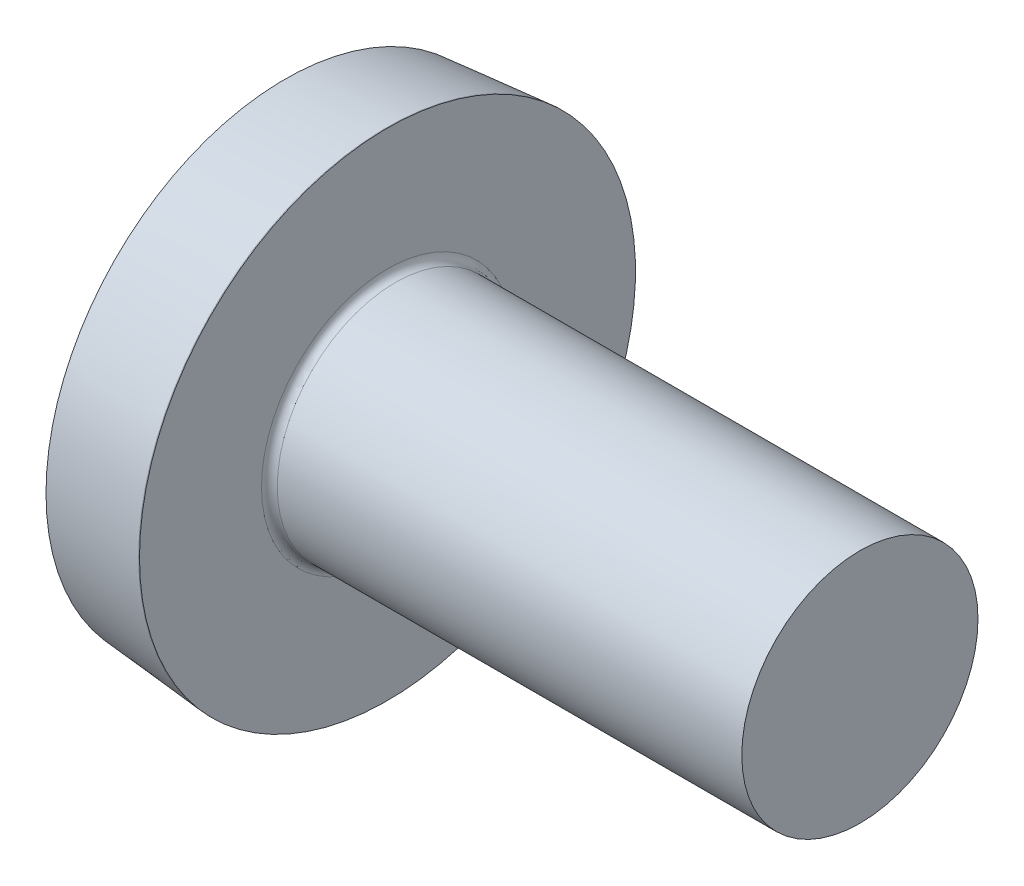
ISO-10303-21;
HEADER;
FILE_DESCRIPTION(('STEP AP214'),'2;1');
FILE_NAME('part.step','',(''),(''),'','','');
FILE_SCHEMA(('AUTOMOTIVE_DESIGN { 1 0 10303 214 1 1 1 1 }'));
ENDSEC;
DATA;
#1=APPLICATION_CONTEXT('core data for automotive mechanical design processes');
#2=APPLICATION_PROTOCOL_DEFINITION('international standard','automotive_design',2000,#1);
#3=PRODUCT_CONTEXT('',#1,'mechanical');
#4=PRODUCT('Part','Part','',(#3));
#5=PRODUCT_RELATED_PRODUCT_CATEGORY('part','',(#4));
#6=PRODUCT_DEFINITION_FORMATION('','',#4);
#7=PRODUCT_DEFINITION_CONTEXT('part definition',#1,'design');
#8=PRODUCT_DEFINITION('design','',#6,#7);
#9=PRODUCT_DEFINITION_SHAPE('','',#8);
#10=(LENGTH_UNIT() NAMED_UNIT(*) SI_UNIT(.MILLI.,.METRE.));
#11=(NAMED_UNIT(*) PLANE_ANGLE_UNIT() SI_UNIT($,.RADIAN.));
#12=(NAMED_UNIT(*) SI_UNIT($,.STERADIAN.) SOLID_ANGLE_UNIT());
#13=UNCERTAINTY_MEASURE_WITH_UNIT(LENGTH_MEASURE(1.E-05),#10,'distance_accuracy_value','');
#14=(GEOMETRIC_REPRESENTATION_CONTEXT(3) GLOBAL_UNCERTAINTY_ASSIGNED_CONTEXT((#13)) GLOBAL_UNIT_ASSIGNED_CONTEXT((#10,
#11,#12)) REPRESENTATION_CONTEXT('',''));
#15=CARTESIAN_POINT('',(0.,0.,0.));
#16=DIRECTION('',(0.,0.,1.));
#17=DIRECTION('',(1.,0.,0.));
#18=AXIS2_PLACEMENT_3D('',#15,#16,#17);
#19=CARTESIAN_POINT('',(7.98684757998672,0.,0.));
#20=DIRECTION('',(-1.,0.,0.));
#21=DIRECTION('',(0.,1.,0.));
#22=AXIS2_PLACEMENT_3D('',#19,#20,#21);
#23=SPHERICAL_SURFACE('',#22,7.98684757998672);
#24=CARTESIAN_POINT('',(0.6,0.,0.));
#25=DIRECTION('',(-1.,0.,0.));
#26=DIRECTION('',(0.,0.,1.));
#27=AXIS2_PLACEMENT_3D('',#24,#25,#26);
#28=CIRCLE('',#27,3.03713962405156);
#29=CARTESIAN_POINT('',(0.6,0.,3.03713962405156));
#30=VERTEX_POINT('',#29);
#31=EDGE_CURVE('E214',#30,#30,#28,.T.);
#32=ORIENTED_EDGE('',*,*,#31,.T.);
#33=EDGE_LOOP('',(#32));
#34=FACE_BOUND('',#33,.T.);
#35=CARTESIAN_POINT('',(0.057179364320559,0.,0.));
#36=DIRECTION('',(1.,0.,0.));
#37=DIRECTION('',(0.,0.,-1.));
#38=AXIS2_PLACEMENT_3D('',#35,#36,#37);
#39=CIRCLE('',#38,0.953989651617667);
#40=CARTESIAN_POINT('',(0.0571793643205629,-0.514999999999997,-0.80303876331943));
#41=VERTEX_POINT('',#40);
#42=CARTESIAN_POINT('',(0.0571793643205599,-0.803038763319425,-0.515));
#43=VERTEX_POINT('',#42);
#44=EDGE_CURVE('E341',#41,#43,#39,.F.);
#45=ORIENTED_EDGE('',*,*,#44,.F.);
#46=CARTESIAN_POINT('',(7.98684757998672,-0.515,0.));
#47=DIRECTION('',(0.,1.,0.));
#48=DIRECTION('',(0.,0.,1.));
#49=AXIS2_PLACEMENT_3D('',#46,#47,#48);
#50=CIRCLE('',#49,7.97022642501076);
#51=CARTESIAN_POINT('',(0.210052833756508,-0.514999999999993,-1.7452715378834));
#52=VERTEX_POINT('',#51);
#53=EDGE_CURVE('E274',#52,#41,#50,.T.);
#54=ORIENTED_EDGE('',*,*,#53,.F.);
#55=CARTESIAN_POINT('',(7.13546441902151,0.,1.70761072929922));
#56=DIRECTION('',(0.446197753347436,0.,-0.894934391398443));
#57=DIRECTION('',(-0.894934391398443,0.,-0.446197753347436));
#58=AXIS2_PLACEMENT_3D('',#55,#56,#57);
#59=CIRCLE('',#58,7.75557519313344);
#60=CARTESIAN_POINT('',(0.210052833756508,0.515000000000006,-1.7452715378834));
#61=VERTEX_POINT('',#60);
#62=EDGE_CURVE('E248',#52,#61,#59,.T.);
#63=ORIENTED_EDGE('',*,*,#62,.T.);
#64=CARTESIAN_POINT('',(7.98684757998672,0.515,0.));
#65=DIRECTION('',(0.,-1.,0.));
#66=DIRECTION('',(0.,0.,-1.));
#67=AXIS2_PLACEMENT_3D('',#64,#65,#66);
#68=CIRCLE('',#67,7.97022642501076);
#69=CARTESIAN_POINT('',(0.0571793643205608,0.515000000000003,-0.803038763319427));
#70=VERTEX_POINT('',#69);
#71=EDGE_CURVE('E303',#70,#61,#68,.T.);
#72=ORIENTED_EDGE('',*,*,#71,.F.);
#73=CARTESIAN_POINT('',(0.0571793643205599,0.803038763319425,-0.515));
#74=VERTEX_POINT('',#73);
#75=EDGE_CURVE('E356',#74,#70,#39,.F.);
#76=ORIENTED_EDGE('',*,*,#75,.F.);
#77=CARTESIAN_POINT('',(7.98684757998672,0.,-0.515));
#78=DIRECTION('',(0.,0.,1.));
#79=DIRECTION('',(1.,0.,0.));
#80=AXIS2_PLACEMENT_3D('',#77,#78,#79);
#81=CIRCLE('',#80,7.97022642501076);
#82=CARTESIAN_POINT('',(0.210052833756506,1.7452715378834,-0.515));
#83=VERTEX_POINT('',#82);
#84=EDGE_CURVE('E242',#83,#74,#81,.T.);
#85=ORIENTED_EDGE('',*,*,#84,.F.);
#86=CARTESIAN_POINT('',(7.13546441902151,-1.70761072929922,0.));
#87=DIRECTION('',(0.446197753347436,0.894934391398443,0.));
#88=DIRECTION('',(-0.894934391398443,0.446197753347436,0.));
#89=AXIS2_PLACEMENT_3D('',#86,#87,#88);
#90=CIRCLE('',#89,7.75557519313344);
#91=CARTESIAN_POINT('',(0.210052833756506,1.7452715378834,0.515));
#92=VERTEX_POINT('',#91);
#93=EDGE_CURVE('E245',#83,#92,#90,.T.);
#94=ORIENTED_EDGE('',*,*,#93,.T.);
#95=CARTESIAN_POINT('',(7.98684757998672,0.,0.515));
#96=DIRECTION('',(0.,0.,-1.));
#97=DIRECTION('',(0.,1.,0.));
#98=AXIS2_PLACEMENT_3D('',#95,#96,#97);
#99=CIRCLE('',#98,7.97022642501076);
#100=CARTESIAN_POINT('',(0.0571793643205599,0.803038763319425,0.515));
#101=VERTEX_POINT('',#100);
#102=EDGE_CURVE('E238',#101,#92,#99,.T.);
#103=ORIENTED_EDGE('',*,*,#102,.F.);
#104=CARTESIAN_POINT('',(0.0571793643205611,0.514999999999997,0.80303876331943));
#105=VERTEX_POINT('',#104);
#106=EDGE_CURVE('E355',#105,#101,#39,.F.);
#107=ORIENTED_EDGE('',*,*,#106,.F.);
#108=CARTESIAN_POINT('',(0.210052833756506,0.514999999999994,1.7452715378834));
#109=VERTEX_POINT('',#108);
#110=EDGE_CURVE('E258',#109,#105,#68,.T.);
#111=ORIENTED_EDGE('',*,*,#110,.F.);
#112=CARTESIAN_POINT('',(7.13546441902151,0.,-1.70761072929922));
#113=DIRECTION('',(0.446197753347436,0.,0.894934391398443));
#114=DIRECTION('',(0.894934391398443,0.,-0.446197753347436));
#115=AXIS2_PLACEMENT_3D('',#112,#113,#114);
#116=CIRCLE('',#115,7.75557519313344);
#117=CARTESIAN_POINT('',(0.210052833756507,-0.515000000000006,1.7452715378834));
#118=VERTEX_POINT('',#117);
#119=EDGE_CURVE('E49',#109,#118,#116,.T.);
#120=ORIENTED_EDGE('',*,*,#119,.T.);
#121=CARTESIAN_POINT('',(0.0571793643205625,-0.515000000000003,0.803038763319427));
#122=VERTEX_POINT('',#121);
#123=EDGE_CURVE('E255',#122,#118,#50,.T.);
#124=ORIENTED_EDGE('',*,*,#123,.F.);
#125=CARTESIAN_POINT('',(0.0571793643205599,-0.803038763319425,0.515));
#126=VERTEX_POINT('',#125);
#127=EDGE_CURVE('E391',#126,#122,#39,.F.);
#128=ORIENTED_EDGE('',*,*,#127,.F.);
#129=CARTESIAN_POINT('',(0.210052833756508,-1.7452715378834,0.515));
#130=VERTEX_POINT('',#129);
#131=EDGE_CURVE('E239',#130,#126,#99,.T.);
#132=ORIENTED_EDGE('',*,*,#131,.F.);
#133=CARTESIAN_POINT('',(7.13546441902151,1.70761072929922,0.));
#134=DIRECTION('',(0.446197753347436,-0.894934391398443,0.));
#135=DIRECTION('',(0.894934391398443,0.446197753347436,0.));
#136=AXIS2_PLACEMENT_3D('',#133,#134,#135);
#137=CIRCLE('',#136,7.75557519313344);
#138=CARTESIAN_POINT('',(0.210052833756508,-1.7452715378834,-0.515));
#139=VERTEX_POINT('',#138);
#140=EDGE_CURVE('E235',#130,#139,#137,.T.);
#141=ORIENTED_EDGE('',*,*,#140,.T.);
#142=EDGE_CURVE('E64',#43,#139,#81,.T.);
#143=ORIENTED_EDGE('',*,*,#142,.F.);
#144=EDGE_LOOP('',(#45,#54,#63,#72,#76,#85,#94,#103,#107,#111,#120,#124,#128,#132,#141,#143));
#145=FACE_BOUND('',#144,.T.);
#146=ADVANCED_FACE('F35',(#34,#145),#23,.T.);
#147=CARTESIAN_POINT('',(1.53,1.08717026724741,-0.515));
#148=DIRECTION('',(0.,0.,1.));
#149=DIRECTION('',(1.,0.,0.));
#150=AXIS2_PLACEMENT_3D('',#147,#148,#149);
#151=PLANE('',#150);
#152=ORIENTED_EDGE('',*,*,#84,.T.);
#153=CARTESIAN_POINT('',(-1.53096593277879,0.932251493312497,-0.515));
#154=CARTESIAN_POINT('',(-1.23829496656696,0.908862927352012,-0.515));
#155=CARTESIAN_POINT('',(-0.945638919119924,0.885284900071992,-0.515));
#156=CARTESIAN_POINT('',(-0.360361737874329,0.837606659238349,-0.515));
#157=CARTESIAN_POINT('',(-0.067740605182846,0.8135064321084,-0.515));
#158=CARTESIAN_POINT('',(0.517446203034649,0.764641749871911,-0.515));
#159=CARTESIAN_POINT('',(0.810011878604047,0.739877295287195,-0.515));
#160=CARTESIAN_POINT('',(1.24879921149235,0.702056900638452,-0.515));
#161=CARTESIAN_POINT('',(1.39504991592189,0.689337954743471,-0.515));
#162=CARTESIAN_POINT('',(1.68752880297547,0.663633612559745,-0.515));
#163=CARTESIAN_POINT('',(1.83375698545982,0.650648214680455,-0.515));
#164=CARTESIAN_POINT('',(2.22932735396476,0.615090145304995,-0.515));
#165=CARTESIAN_POINT('',(2.47864256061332,0.592216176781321,-0.515));
#166=CARTESIAN_POINT('',(2.97714936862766,0.545192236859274,-0.515));
#167=CARTESIAN_POINT('',(3.22634097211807,0.521042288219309,-0.515));
#168=CARTESIAN_POINT('',(3.59999645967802,0.483370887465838,-0.515));
#169=CARTESIAN_POINT('',(3.72453302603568,0.470571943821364,-0.515));
#170=CARTESIAN_POINT('',(3.97353967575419,0.444352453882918,-0.515));
#171=CARTESIAN_POINT('',(4.09800975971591,0.430931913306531,-0.515));
#172=CARTESIAN_POINT('',(4.34687040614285,0.403288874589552,-0.515));
#173=CARTESIAN_POINT('',(4.471260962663,0.389066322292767,-0.515));
#174=CARTESIAN_POINT('',(4.71990866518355,0.359471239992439,-0.515));
#175=CARTESIAN_POINT('',(4.84416580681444,0.344098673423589,-0.515));
#176=CARTESIAN_POINT('',(4.968329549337,0.327977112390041,-0.515));
#177=B_SPLINE_CURVE_WITH_KNOTS('',3,(#153,#154,#155,#156,#157,#158,#159,#160,#161,#162,#163,
#164,#165,#166,#167,#168,#169,#170,#171,#172,#173,#174,#175,#176),.UNSPECIFIED.,.F.,.F.,(4,2,2,
2,2,2,2,2,2,2,2,4),(0.,0.880812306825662,1.76164754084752,2.64248208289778,3.08289005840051,
3.52330066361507,4.27438561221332,5.02545716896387,5.40103352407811,5.77660642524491,
6.15220471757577,6.52781495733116),.UNSPECIFIED.);
#178=CARTESIAN_POINT('',(1.53,0.677477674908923,-0.515));
#179=VERTEX_POINT('',#178);
#180=EDGE_CURVE('E378',#74,#179,#177,.T.);
#181=ORIENTED_EDGE('',*,*,#180,.T.);
#182=DIRECTION('',(0.,1.,0.));
#183=VECTOR('',#182,1.);
#184=CARTESIAN_POINT('',(1.53,-1.08717026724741,-0.515));
#185=LINE('',#184,#183);
#186=CARTESIAN_POINT('',(1.53,1.08717026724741,-0.515));
#187=VERTEX_POINT('',#186);
#188=EDGE_CURVE('E324',#179,#187,#185,.T.);
#189=ORIENTED_EDGE('',*,*,#188,.T.);
#190=DIRECTION('',(0.894934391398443,-0.446197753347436,0.));
#191=VECTOR('',#190,1.);
#192=CARTESIAN_POINT('',(0.,1.85,-0.515));
#193=LINE('',#192,#191);
#194=EDGE_CURVE('E215',#83,#187,#193,.T.);
#195=ORIENTED_EDGE('',*,*,#194,.F.);
#196=EDGE_LOOP('',(#152,#181,#189,#195));
#197=FACE_BOUND('',#196,.T.);
#198=ADVANCED_FACE('F170',(#197),#151,.T.);
#199=CARTESIAN_POINT('',(1.53,-1.08717026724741,-0.515));
#200=VERTEX_POINT('',#199);
#201=CARTESIAN_POINT('',(1.53,-0.677477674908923,-0.515));
#202=VERTEX_POINT('',#201);
#203=EDGE_CURVE('E223',#200,#202,#185,.T.);
#204=ORIENTED_EDGE('',*,*,#203,.T.);
#205=CARTESIAN_POINT('',(-1.53096593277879,-0.932251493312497,-0.515));
#206=CARTESIAN_POINT('',(-1.23829496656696,-0.908862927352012,-0.515));
#207=CARTESIAN_POINT('',(-0.945638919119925,-0.885284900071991,-0.515));
#208=CARTESIAN_POINT('',(-0.360361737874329,-0.837606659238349,-0.515));
#209=CARTESIAN_POINT('',(-0.0677406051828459,-0.8135064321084,-0.515));
#210=CARTESIAN_POINT('',(0.517446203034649,-0.764641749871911,-0.515));
#211=CARTESIAN_POINT('',(0.810011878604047,-0.739877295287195,-0.515));
#212=CARTESIAN_POINT('',(1.24879921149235,-0.702056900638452,-0.515));
#213=CARTESIAN_POINT('',(1.39504991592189,-0.689337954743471,-0.515));
#214=CARTESIAN_POINT('',(1.68752880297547,-0.663633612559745,-0.515));
#215=CARTESIAN_POINT('',(1.83375698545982,-0.650648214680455,-0.515));
#216=CARTESIAN_POINT('',(2.22932735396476,-0.615090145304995,-0.515));
#217=CARTESIAN_POINT('',(2.47864256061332,-0.592216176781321,-0.515));
#218=CARTESIAN_POINT('',(2.97714936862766,-0.545192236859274,-0.515));
#219=CARTESIAN_POINT('',(3.22634097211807,-0.521042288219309,-0.515));
#220=CARTESIAN_POINT('',(3.59999645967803,-0.483370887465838,-0.515));
#221=CARTESIAN_POINT('',(3.72453302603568,-0.470571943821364,-0.515));
#222=CARTESIAN_POINT('',(3.97353967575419,-0.444352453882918,-0.515));
#223=CARTESIAN_POINT('',(4.09800975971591,-0.430931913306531,-0.515));
#224=CARTESIAN_POINT('',(4.34687040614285,-0.403288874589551,-0.515));
#225=CARTESIAN_POINT('',(4.471260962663,-0.389066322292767,-0.515));
#226=CARTESIAN_POINT('',(4.71990866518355,-0.359471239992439,-0.515));
#227=CARTESIAN_POINT('',(4.84416580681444,-0.344098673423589,-0.515));
#228=CARTESIAN_POINT('',(4.96832954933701,-0.32797711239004,-0.515));
#229=B_SPLINE_CURVE_WITH_KNOTS('',3,(#205,#206,#207,#208,#209,#210,#211,#212,#213,#214,#215,
#216,#217,#218,#219,#220,#221,#222,#223,#224,#225,#226,#227,#228),.UNSPECIFIED.,.F.,.F.,(4,2,2,
2,2,2,2,2,2,2,2,4),(0.,0.880812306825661,1.76164754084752,2.64248208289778,3.08289005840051,
3.52330066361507,4.27438561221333,5.02545716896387,5.40103352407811,5.77660642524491,
6.15220471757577,6.52781495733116),.UNSPECIFIED.);
#230=EDGE_CURVE('E354',#202,#43,#229,.F.);
#231=ORIENTED_EDGE('',*,*,#230,.T.);
#232=ORIENTED_EDGE('',*,*,#142,.T.);
#233=DIRECTION('',(0.894934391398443,0.446197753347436,0.));
#234=VECTOR('',#233,1.);
#235=CARTESIAN_POINT('',(0.,-1.85,-0.515));
#236=LINE('',#235,#234);
#237=EDGE_CURVE('E306',#139,#200,#236,.T.);
#238=ORIENTED_EDGE('',*,*,#237,.T.);
#239=EDGE_LOOP('',(#204,#231,#232,#238));
#240=FACE_BOUND('',#239,.T.);
#241=ADVANCED_FACE('F176',(#240),#151,.T.);
#242=CARTESIAN_POINT('',(1.53,-1.08717026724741,0.515));
#243=DIRECTION('',(0.,0.,-1.));
#244=DIRECTION('',(0.,1.,0.));
#245=AXIS2_PLACEMENT_3D('',#242,#243,#244);
#246=PLANE('',#245);
#247=DIRECTION('',(0.,-1.,0.));
#248=VECTOR('',#247,1.);
#249=CARTESIAN_POINT('',(1.53,1.08717026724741,0.515));
#250=LINE('',#249,#248);
#251=CARTESIAN_POINT('',(1.53,1.08717026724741,0.515));
#252=VERTEX_POINT('',#251);
#253=CARTESIAN_POINT('',(1.53,0.677477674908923,0.515));
#254=VERTEX_POINT('',#253);
#255=EDGE_CURVE('E314',#252,#254,#250,.T.);
#256=ORIENTED_EDGE('',*,*,#255,.T.);
#257=CARTESIAN_POINT('',(-1.53096593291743,0.932251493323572,0.515));
#258=CARTESIAN_POINT('',(-1.23829496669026,0.908862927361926,0.515));
#259=CARTESIAN_POINT('',(-0.945638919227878,0.885284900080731,0.515));
#260=CARTESIAN_POINT('',(-0.360361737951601,0.8376066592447,0.515));
#261=CARTESIAN_POINT('',(-0.0677406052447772,0.813506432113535,0.515));
#262=CARTESIAN_POINT('',(0.517446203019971,0.764641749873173,0.515));
#263=CARTESIAN_POINT('',(0.810011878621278,0.739877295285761,0.515));
#264=CARTESIAN_POINT('',(1.24879921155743,0.702056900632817,0.515));
#265=CARTESIAN_POINT('',(1.39504991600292,0.68933795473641,0.515));
#266=CARTESIAN_POINT('',(1.68752880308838,0.663633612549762,0.515));
#267=CARTESIAN_POINT('',(1.83375698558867,0.650648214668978,0.515));
#268=CARTESIAN_POINT('',(2.22932735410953,0.615090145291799,0.515));
#269=CARTESIAN_POINT('',(2.47864256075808,0.592216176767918,0.515));
#270=CARTESIAN_POINT('',(2.97714936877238,0.545192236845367,0.515));
#271=CARTESIAN_POINT('',(3.22634097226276,0.521042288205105,0.515));
#272=CARTESIAN_POINT('',(3.59999645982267,0.483370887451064,0.515));
#273=CARTESIAN_POINT('',(3.72453302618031,0.470571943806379,0.515));
#274=CARTESIAN_POINT('',(3.97353967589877,0.44435245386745,0.515));
#275=CARTESIAN_POINT('',(4.09800975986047,0.43093191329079,0.515));
#276=CARTESIAN_POINT('',(4.34687040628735,0.403288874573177,0.515));
#277=CARTESIAN_POINT('',(4.47126096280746,0.38906632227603,0.515));
#278=CARTESIAN_POINT('',(4.71990866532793,0.359471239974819,0.515));
#279=CARTESIAN_POINT('',(4.84416580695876,0.344098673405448,0.515));
#280=CARTESIAN_POINT('',(4.96832954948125,0.327977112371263,0.515));
#281=B_SPLINE_CURVE_WITH_KNOTS('',3,(#257,#258,#259,#260,#261,#262,#263,#264,#265,#266,#267,
#268,#269,#270,#271,#272,#273,#274,#275,#276,#277,#278,#279,#280),.UNSPECIFIED.,.F.,.F.,(4,2,2,
2,2,2,2,2,2,2,2,4),(0.,0.880812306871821,1.76164754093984,2.64248208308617,3.08289005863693,
3.52330066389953,4.27438561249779,5.02545716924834,5.4010335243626,5.77660642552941,
6.15220471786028,6.5278149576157),.UNSPECIFIED.);
#282=EDGE_CURVE('E279',#254,#101,#281,.F.);
#283=ORIENTED_EDGE('',*,*,#282,.T.);
#284=ORIENTED_EDGE('',*,*,#102,.T.);
#285=DIRECTION('',(0.894934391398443,-0.446197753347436,0.));
#286=VECTOR('',#285,1.);
#287=CARTESIAN_POINT('',(0.,1.85,0.515));
#288=LINE('',#287,#286);
#289=EDGE_CURVE('E220',#92,#252,#288,.T.);
#290=ORIENTED_EDGE('',*,*,#289,.T.);
#291=EDGE_LOOP('',(#256,#283,#284,#290));
#292=FACE_BOUND('',#291,.T.);
#293=ADVANCED_FACE('F374',(#292),#246,.T.);
#294=ORIENTED_EDGE('',*,*,#131,.T.);
#295=CARTESIAN_POINT('',(-1.53096593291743,-0.932251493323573,0.515));
#296=CARTESIAN_POINT('',(-1.23829496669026,-0.908862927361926,0.515));
#297=CARTESIAN_POINT('',(-0.945638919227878,-0.885284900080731,0.515));
#298=CARTESIAN_POINT('',(-0.360361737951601,-0.8376066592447,0.515));
#299=CARTESIAN_POINT('',(-0.0677406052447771,-0.813506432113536,0.515));
#300=CARTESIAN_POINT('',(0.517446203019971,-0.764641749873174,0.515));
#301=CARTESIAN_POINT('',(0.810011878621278,-0.739877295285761,0.515));
#302=CARTESIAN_POINT('',(1.24879921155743,-0.702056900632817,0.515));
#303=CARTESIAN_POINT('',(1.39504991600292,-0.68933795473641,0.515));
#304=CARTESIAN_POINT('',(1.68752880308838,-0.663633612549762,0.515));
#305=CARTESIAN_POINT('',(1.83375698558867,-0.650648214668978,0.515));
#306=CARTESIAN_POINT('',(2.22932735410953,-0.6150901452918,0.515));
#307=CARTESIAN_POINT('',(2.47864256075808,-0.592216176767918,0.515));
#308=CARTESIAN_POINT('',(2.97714936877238,-0.545192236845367,0.515));
#309=CARTESIAN_POINT('',(3.22634097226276,-0.521042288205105,0.515));
#310=CARTESIAN_POINT('',(3.59999645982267,-0.483370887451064,0.515));
#311=CARTESIAN_POINT('',(3.72453302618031,-0.470571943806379,0.515));
#312=CARTESIAN_POINT('',(3.97353967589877,-0.44435245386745,0.515));
#313=CARTESIAN_POINT('',(4.09800975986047,-0.43093191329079,0.515));
#314=CARTESIAN_POINT('',(4.34687040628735,-0.403288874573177,0.515));
#315=CARTESIAN_POINT('',(4.47126096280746,-0.389066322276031,0.515));
#316=CARTESIAN_POINT('',(4.71990866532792,-0.35947123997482,0.515));
#317=CARTESIAN_POINT('',(4.84416580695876,-0.344098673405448,0.515));
#318=CARTESIAN_POINT('',(4.96832954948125,-0.327977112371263,0.515));
#319=B_SPLINE_CURVE_WITH_KNOTS('',3,(#295,#296,#297,#298,#299,#300,#301,#302,#303,#304,#305,
#306,#307,#308,#309,#310,#311,#312,#313,#314,#315,#316,#317,#318),.UNSPECIFIED.,.F.,.F.,(4,2,2,
2,2,2,2,2,2,2,2,4),(0.,0.880812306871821,1.76164754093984,2.64248208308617,3.08289005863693,
3.52330066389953,4.27438561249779,5.02545716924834,5.4010335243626,5.77660642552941,
6.15220471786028,6.52781495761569),.UNSPECIFIED.);
#320=CARTESIAN_POINT('',(1.53,-0.677477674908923,0.515));
#321=VERTEX_POINT('',#320);
#322=EDGE_CURVE('E392',#126,#321,#319,.T.);
#323=ORIENTED_EDGE('',*,*,#322,.T.);
#324=CARTESIAN_POINT('',(1.53,-1.08717026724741,0.515));
#325=VERTEX_POINT('',#324);
#326=EDGE_CURVE('E316',#321,#325,#250,.T.);
#327=ORIENTED_EDGE('',*,*,#326,.T.);
#328=DIRECTION('',(0.894934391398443,0.446197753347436,0.));
#329=VECTOR('',#328,1.);
#330=CARTESIAN_POINT('',(0.,-1.85,0.515));
#331=LINE('',#330,#329);
#332=EDGE_CURVE('E308',#130,#325,#331,.T.);
#333=ORIENTED_EDGE('',*,*,#332,.F.);
#334=EDGE_LOOP('',(#294,#323,#327,#333));
#335=FACE_BOUND('',#334,.T.);
#336=ADVANCED_FACE('F422',(#335),#246,.T.);
#337=CARTESIAN_POINT('',(1.53,1.08717026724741,-0.515));
#338=DIRECTION('',(-1.,0.,0.));
#339=DIRECTION('',(0.,0.,1.));
#340=AXIS2_PLACEMENT_3D('',#337,#338,#339);
#341=PLANE('',#340);
#342=ORIENTED_EDGE('',*,*,#326,.F.);
#343=CARTESIAN_POINT('',(1.53,0.,0.));
#344=DIRECTION('',(-1.,0.,0.));
#345=DIRECTION('',(0.,0.,1.));
#346=AXIS2_PLACEMENT_3D('',#343,#344,#345);
#347=CIRCLE('',#346,0.851);
#348=EDGE_CURVE('E349',#202,#321,#347,.T.);
#349=ORIENTED_EDGE('',*,*,#348,.F.);
#350=ORIENTED_EDGE('',*,*,#203,.F.);
#351=DIRECTION('',(0.,0.,1.));
#352=VECTOR('',#351,1.);
#353=CARTESIAN_POINT('',(1.53,-1.08717026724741,-0.515));
#354=LINE('',#353,#352);
#355=EDGE_CURVE('E311',#200,#325,#354,.T.);
#356=ORIENTED_EDGE('',*,*,#355,.T.);
#357=EDGE_LOOP('',(#342,#349,#350,#356));
#358=FACE_BOUND('',#357,.T.);
#359=ADVANCED_FACE('F415',(#358),#341,.T.);
#360=DIRECTION('',(0.,0.,-1.));
#361=VECTOR('',#360,1.);
#362=CARTESIAN_POINT('',(1.53,-0.515000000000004,1.08717026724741));
#363=LINE('',#362,#361);
#364=CARTESIAN_POINT('',(1.53,-0.514999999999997,-0.677477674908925));
#365=VERTEX_POINT('',#364);
#366=CARTESIAN_POINT('',(1.53,-0.514999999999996,-1.08717026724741));
#367=VERTEX_POINT('',#366);
#368=EDGE_CURVE('E297',#365,#367,#363,.T.);
#369=ORIENTED_EDGE('',*,*,#368,.F.);
#370=CARTESIAN_POINT('',(1.53,0.515000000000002,-0.677477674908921));
#371=VERTEX_POINT('',#370);
#372=EDGE_CURVE('E56',#371,#365,#347,.T.);
#373=ORIENTED_EDGE('',*,*,#372,.F.);
#374=DIRECTION('',(0.,0.,1.));
#375=VECTOR('',#374,1.);
#376=CARTESIAN_POINT('',(1.53,0.515000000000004,-1.08717026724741));
#377=LINE('',#376,#375);
#378=CARTESIAN_POINT('',(1.53,0.515000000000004,-1.08717026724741));
#379=VERTEX_POINT('',#378);
#380=EDGE_CURVE('E300',#379,#371,#377,.T.);
#381=ORIENTED_EDGE('',*,*,#380,.F.);
#382=DIRECTION('',(0.,-1.,0.));
#383=VECTOR('',#382,1.);
#384=CARTESIAN_POINT('',(1.53,0.515000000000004,-1.08717026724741));
#385=LINE('',#384,#383);
#386=EDGE_CURVE('E291',#379,#367,#385,.T.);
#387=ORIENTED_EDGE('',*,*,#386,.T.);
#388=EDGE_LOOP('',(#369,#373,#381,#387));
#389=FACE_BOUND('',#388,.T.);
#390=ADVANCED_FACE('F344',(#389),#341,.T.);
#391=ORIENTED_EDGE('',*,*,#188,.F.);
#392=EDGE_CURVE('E348',#254,#179,#347,.T.);
#393=ORIENTED_EDGE('',*,*,#392,.F.);
#394=ORIENTED_EDGE('',*,*,#255,.F.);
#395=DIRECTION('',(0.,0.,-1.));
#396=VECTOR('',#395,1.);
#397=CARTESIAN_POINT('',(1.53,1.08717026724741,0.515));
#398=LINE('',#397,#396);
#399=EDGE_CURVE('E317',#252,#187,#398,.T.);
#400=ORIENTED_EDGE('',*,*,#399,.T.);
#401=EDGE_LOOP('',(#391,#393,#394,#400));
#402=FACE_BOUND('',#401,.T.);
#403=ADVANCED_FACE('F416',(#402),#341,.T.);
#404=CARTESIAN_POINT('',(1.53,0.514999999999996,1.08717026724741));
#405=DIRECTION('',(0.,-1.,0.));
#406=DIRECTION('',(1.,0.,0.));
#407=AXIS2_PLACEMENT_3D('',#404,#405,#406);
#408=PLANE('',#407);
#409=ORIENTED_EDGE('',*,*,#110,.T.);
#410=CARTESIAN_POINT('',(-1.53096593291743,0.514999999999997,0.932251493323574));
#411=CARTESIAN_POINT('',(-1.23829496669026,0.514999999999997,0.908862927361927));
#412=CARTESIAN_POINT('',(-0.945638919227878,0.514999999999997,0.885284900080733));
#413=CARTESIAN_POINT('',(-0.360361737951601,0.514999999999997,0.837606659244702));
#414=CARTESIAN_POINT('',(-0.0677406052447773,0.514999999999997,0.813506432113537));
#415=CARTESIAN_POINT('',(0.517446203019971,0.514999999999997,0.764641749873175));
#416=CARTESIAN_POINT('',(0.810011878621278,0.514999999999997,0.739877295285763));
#417=CARTESIAN_POINT('',(1.24879921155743,0.514999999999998,0.702056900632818));
#418=CARTESIAN_POINT('',(1.39504991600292,0.514999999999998,0.689337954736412));
#419=CARTESIAN_POINT('',(1.68752880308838,0.514999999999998,0.663633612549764));
#420=CARTESIAN_POINT('',(1.83375698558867,0.514999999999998,0.650648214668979));
#421=CARTESIAN_POINT('',(2.22932735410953,0.514999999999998,0.615090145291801));
#422=CARTESIAN_POINT('',(2.47864256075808,0.514999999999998,0.59221617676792));
#423=CARTESIAN_POINT('',(2.97714936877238,0.514999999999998,0.545192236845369));
#424=CARTESIAN_POINT('',(3.22634097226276,0.514999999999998,0.521042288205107));
#425=CARTESIAN_POINT('',(3.59999645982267,0.514999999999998,0.483370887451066));
#426=CARTESIAN_POINT('',(3.72453302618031,0.514999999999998,0.470571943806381));
#427=CARTESIAN_POINT('',(3.97353967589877,0.514999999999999,0.444352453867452));
#428=CARTESIAN_POINT('',(4.09800975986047,0.514999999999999,0.430931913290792));
#429=CARTESIAN_POINT('',(4.34687040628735,0.514999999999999,0.403288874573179));
#430=CARTESIAN_POINT('',(4.47126096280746,0.514999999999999,0.389066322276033));
#431=CARTESIAN_POINT('',(4.71990866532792,0.514999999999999,0.359471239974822));
#432=CARTESIAN_POINT('',(4.84416580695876,0.514999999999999,0.34409867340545));
#433=CARTESIAN_POINT('',(4.96832954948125,0.514999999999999,0.327977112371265));
#434=B_SPLINE_CURVE_WITH_KNOTS('',3,(#410,#411,#412,#413,#414,#415,#416,#417,#418,#419,#420,
#421,#422,#423,#424,#425,#426,#427,#428,#429,#430,#431,#432,#433),.UNSPECIFIED.,.F.,.F.,(4,2,2,
2,2,2,2,2,2,2,2,4),(0.,0.88081230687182,1.76164754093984,2.64248208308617,3.08289005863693,
3.52330066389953,4.27438561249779,5.02545716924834,5.4010335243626,5.77660642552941,
6.15220471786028,6.52781495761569),.UNSPECIFIED.);
#435=CARTESIAN_POINT('',(1.53,0.514999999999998,0.677477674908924));
#436=VERTEX_POINT('',#435);
#437=EDGE_CURVE('E440',#105,#436,#434,.T.);
#438=ORIENTED_EDGE('',*,*,#437,.T.);
#439=CARTESIAN_POINT('',(1.53,0.514999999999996,1.08717026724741));
#440=VERTEX_POINT('',#439);
#441=EDGE_CURVE('E272',#436,#440,#377,.T.);
#442=ORIENTED_EDGE('',*,*,#441,.T.);
#443=DIRECTION('',(0.894934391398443,0.,-0.446197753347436));
#444=VECTOR('',#443,1.);
#445=CARTESIAN_POINT('',(0.,0.514999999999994,1.85));
#446=LINE('',#445,#444);
#447=EDGE_CURVE('E265',#109,#440,#446,.T.);
#448=ORIENTED_EDGE('',*,*,#447,.F.);
#449=EDGE_LOOP('',(#409,#438,#442,#448));
#450=FACE_BOUND('',#449,.T.);
#451=ADVANCED_FACE('F269',(#450),#408,.T.);
#452=CARTESIAN_POINT('',(1.53,-0.514999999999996,-1.08717026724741));
#453=DIRECTION('',(0.,1.,0.));
#454=DIRECTION('',(0.,0.,1.));
#455=AXIS2_PLACEMENT_3D('',#452,#453,#454);
#456=PLANE('',#455);
#457=CARTESIAN_POINT('',(1.53,-0.515000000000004,1.08717026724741));
#458=VERTEX_POINT('',#457);
#459=CARTESIAN_POINT('',(1.53,-0.515000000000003,0.677477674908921));
#460=VERTEX_POINT('',#459);
#461=EDGE_CURVE('E294',#458,#460,#363,.T.);
#462=ORIENTED_EDGE('',*,*,#461,.T.);
#463=CARTESIAN_POINT('',(-1.53096593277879,-0.515000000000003,0.932251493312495));
#464=CARTESIAN_POINT('',(-1.23829496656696,-0.515000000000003,0.90886292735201));
#465=CARTESIAN_POINT('',(-0.945638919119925,-0.515000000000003,0.88528490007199));
#466=CARTESIAN_POINT('',(-0.36036173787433,-0.515000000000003,0.837606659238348));
#467=CARTESIAN_POINT('',(-0.0677406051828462,-0.515000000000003,0.813506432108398));
#468=CARTESIAN_POINT('',(0.517446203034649,-0.515000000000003,0.76464174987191));
#469=CARTESIAN_POINT('',(0.810011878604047,-0.515000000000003,0.739877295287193));
#470=CARTESIAN_POINT('',(1.24879921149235,-0.515000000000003,0.70205690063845));
#471=CARTESIAN_POINT('',(1.39504991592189,-0.515000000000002,0.68933795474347));
#472=CARTESIAN_POINT('',(1.68752880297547,-0.515000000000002,0.663633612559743));
#473=CARTESIAN_POINT('',(1.83375698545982,-0.515000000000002,0.650648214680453));
#474=CARTESIAN_POINT('',(2.22932735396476,-0.515000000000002,0.615090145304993));
#475=CARTESIAN_POINT('',(2.47864256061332,-0.515000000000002,0.592216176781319));
#476=CARTESIAN_POINT('',(2.97714936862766,-0.515000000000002,0.545192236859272));
#477=CARTESIAN_POINT('',(3.22634097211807,-0.515000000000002,0.521042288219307));
#478=CARTESIAN_POINT('',(3.59999645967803,-0.515000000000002,0.483370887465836));
#479=CARTESIAN_POINT('',(3.72453302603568,-0.515000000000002,0.470571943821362));
#480=CARTESIAN_POINT('',(3.97353967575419,-0.515000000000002,0.444352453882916));
#481=CARTESIAN_POINT('',(4.09800975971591,-0.515000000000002,0.430931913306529));
#482=CARTESIAN_POINT('',(4.34687040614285,-0.515000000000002,0.40328887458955));
#483=CARTESIAN_POINT('',(4.471260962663,-0.515000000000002,0.389066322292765));
#484=CARTESIAN_POINT('',(4.71990866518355,-0.515000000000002,0.359471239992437));
#485=CARTESIAN_POINT('',(4.84416580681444,-0.515000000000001,0.344098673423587));
#486=CARTESIAN_POINT('',(4.96832954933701,-0.515000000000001,0.327977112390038));
#487=B_SPLINE_CURVE_WITH_KNOTS('',3,(#463,#464,#465,#466,#467,#468,#469,#470,#471,#472,#473,
#474,#475,#476,#477,#478,#479,#480,#481,#482,#483,#484,#485,#486),.UNSPECIFIED.,.F.,.F.,(4,2,2,
2,2,2,2,2,2,2,2,4),(0.,0.880812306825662,1.76164754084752,2.64248208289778,3.08289005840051,
3.52330066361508,4.27438561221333,5.02545716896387,5.40103352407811,5.77660642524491,
6.15220471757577,6.52781495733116),.UNSPECIFIED.);
#488=EDGE_CURVE('E384',#460,#122,#487,.F.);
#489=ORIENTED_EDGE('',*,*,#488,.T.);
#490=ORIENTED_EDGE('',*,*,#123,.T.);
#491=DIRECTION('',(0.894934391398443,0.,-0.446197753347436));
#492=VECTOR('',#491,1.);
#493=CARTESIAN_POINT('',(0.,-0.515000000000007,1.85));
#494=LINE('',#493,#492);
#495=EDGE_CURVE('E267',#118,#458,#494,.T.);
#496=ORIENTED_EDGE('',*,*,#495,.T.);
#497=EDGE_LOOP('',(#462,#489,#490,#496));
#498=FACE_BOUND('',#497,.T.);
#499=ADVANCED_FACE('F205',(#498),#456,.T.);
#500=ORIENTED_EDGE('',*,*,#380,.T.);
#501=CARTESIAN_POINT('',(-1.53096593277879,0.515000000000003,-0.932251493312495));
#502=CARTESIAN_POINT('',(-1.23829496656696,0.515000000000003,-0.90886292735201));
#503=CARTESIAN_POINT('',(-0.945638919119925,0.515000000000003,-0.885284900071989));
#504=CARTESIAN_POINT('',(-0.360361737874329,0.515000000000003,-0.837606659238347));
#505=CARTESIAN_POINT('',(-0.0677406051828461,0.515000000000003,-0.813506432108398));
#506=CARTESIAN_POINT('',(0.517446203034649,0.515000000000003,-0.76464174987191));
#507=CARTESIAN_POINT('',(0.810011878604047,0.515000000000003,-0.739877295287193));
#508=CARTESIAN_POINT('',(1.24879921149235,0.515000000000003,-0.70205690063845));
#509=CARTESIAN_POINT('',(1.39504991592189,0.515000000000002,-0.68933795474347));
#510=CARTESIAN_POINT('',(1.68752880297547,0.515000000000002,-0.663633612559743));
#511=CARTESIAN_POINT('',(1.83375698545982,0.515000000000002,-0.650648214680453));
#512=CARTESIAN_POINT('',(2.22932735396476,0.515000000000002,-0.615090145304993));
#513=CARTESIAN_POINT('',(2.47864256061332,0.515000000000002,-0.592216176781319));
#514=CARTESIAN_POINT('',(2.97714936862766,0.515000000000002,-0.545192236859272));
#515=CARTESIAN_POINT('',(3.22634097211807,0.515000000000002,-0.521042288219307));
#516=CARTESIAN_POINT('',(3.59999645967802,0.515000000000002,-0.483370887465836));
#517=CARTESIAN_POINT('',(3.72453302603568,0.515000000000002,-0.470571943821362));
#518=CARTESIAN_POINT('',(3.97353967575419,0.515000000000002,-0.444352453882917));
#519=CARTESIAN_POINT('',(4.09800975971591,0.515000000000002,-0.430931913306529));
#520=CARTESIAN_POINT('',(4.34687040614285,0.515000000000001,-0.40328887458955));
#521=CARTESIAN_POINT('',(4.471260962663,0.515000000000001,-0.389066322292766));
#522=CARTESIAN_POINT('',(4.71990866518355,0.515000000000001,-0.359471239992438));
#523=CARTESIAN_POINT('',(4.84416580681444,0.515000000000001,-0.344098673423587));
#524=CARTESIAN_POINT('',(4.968329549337,0.515000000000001,-0.327977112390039));
#525=B_SPLINE_CURVE_WITH_KNOTS('',3,(#501,#502,#503,#504,#505,#506,#507,#508,#509,#510,#511,
#512,#513,#514,#515,#516,#517,#518,#519,#520,#521,#522,#523,#524),.UNSPECIFIED.,.F.,.F.,(4,2,2,
2,2,2,2,2,2,2,2,4),(0.,0.880812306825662,1.76164754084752,2.64248208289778,3.08289005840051,
3.52330066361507,4.27438561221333,5.02545716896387,5.40103352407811,5.77660642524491,
6.15220471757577,6.52781495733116),.UNSPECIFIED.);
#526=EDGE_CURVE('E333',#371,#70,#525,.F.);
#527=ORIENTED_EDGE('',*,*,#526,.T.);
#528=ORIENTED_EDGE('',*,*,#71,.T.);
#529=DIRECTION('',(0.894934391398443,0.,0.446197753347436));
#530=VECTOR('',#529,1.);
#531=CARTESIAN_POINT('',(0.,0.515000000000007,-1.85));
#532=LINE('',#531,#530);
#533=EDGE_CURVE('E276',#61,#379,#532,.T.);
#534=ORIENTED_EDGE('',*,*,#533,.T.);
#535=EDGE_LOOP('',(#500,#527,#528,#534));
#536=FACE_BOUND('',#535,.T.);
#537=ADVANCED_FACE('F203',(#536),#408,.T.);
#538=ORIENTED_EDGE('',*,*,#53,.T.);
#539=CARTESIAN_POINT('',(-1.53096593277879,-0.514999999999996,-0.932251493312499));
#540=CARTESIAN_POINT('',(-1.23829496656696,-0.514999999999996,-0.908862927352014));
#541=CARTESIAN_POINT('',(-0.945638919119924,-0.514999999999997,-0.885284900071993));
#542=CARTESIAN_POINT('',(-0.360361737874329,-0.514999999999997,-0.837606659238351));
#543=CARTESIAN_POINT('',(-0.0677406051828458,-0.514999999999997,-0.813506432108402));
#544=CARTESIAN_POINT('',(0.51744620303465,-0.514999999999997,-0.764641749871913));
#545=CARTESIAN_POINT('',(0.810011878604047,-0.514999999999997,-0.739877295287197));
#546=CARTESIAN_POINT('',(1.24879921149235,-0.514999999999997,-0.702056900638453));
#547=CARTESIAN_POINT('',(1.39504991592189,-0.514999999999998,-0.689337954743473));
#548=CARTESIAN_POINT('',(1.68752880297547,-0.514999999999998,-0.663633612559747));
#549=CARTESIAN_POINT('',(1.83375698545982,-0.514999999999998,-0.650648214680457));
#550=CARTESIAN_POINT('',(2.22932735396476,-0.514999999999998,-0.615090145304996));
#551=CARTESIAN_POINT('',(2.47864256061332,-0.514999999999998,-0.592216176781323));
#552=CARTESIAN_POINT('',(2.97714936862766,-0.514999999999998,-0.545192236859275));
#553=CARTESIAN_POINT('',(3.22634097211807,-0.514999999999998,-0.521042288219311));
#554=CARTESIAN_POINT('',(3.59999645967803,-0.514999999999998,-0.48337088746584));
#555=CARTESIAN_POINT('',(3.72453302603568,-0.514999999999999,-0.470571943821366));
#556=CARTESIAN_POINT('',(3.97353967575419,-0.514999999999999,-0.44435245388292));
#557=CARTESIAN_POINT('',(4.09800975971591,-0.514999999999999,-0.430931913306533));
#558=CARTESIAN_POINT('',(4.34687040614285,-0.514999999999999,-0.403288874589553));
#559=CARTESIAN_POINT('',(4.471260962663,-0.514999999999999,-0.389066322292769));
#560=CARTESIAN_POINT('',(4.71990866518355,-0.514999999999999,-0.359471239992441));
#561=CARTESIAN_POINT('',(4.84416580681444,-0.514999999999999,-0.344098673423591));
#562=CARTESIAN_POINT('',(4.96832954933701,-0.514999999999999,-0.327977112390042));
#563=B_SPLINE_CURVE_WITH_KNOTS('',3,(#539,#540,#541,#542,#543,#544,#545,#546,#547,#548,#549,
#550,#551,#552,#553,#554,#555,#556,#557,#558,#559,#560,#561,#562),.UNSPECIFIED.,.F.,.F.,(4,2,2,
2,2,2,2,2,2,2,2,4),(0.,0.880812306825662,1.76164754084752,2.64248208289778,3.08289005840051,
3.52330066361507,4.27438561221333,5.02545716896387,5.40103352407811,5.77660642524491,
6.15220471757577,6.52781495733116),.UNSPECIFIED.);
#564=EDGE_CURVE('E11',#41,#365,#563,.T.);
#565=ORIENTED_EDGE('',*,*,#564,.T.);
#566=ORIENTED_EDGE('',*,*,#368,.T.);
#567=DIRECTION('',(0.894934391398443,0.,0.446197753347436));
#568=VECTOR('',#567,1.);
#569=CARTESIAN_POINT('',(0.,-0.514999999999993,-1.85));
#570=LINE('',#569,#568);
#571=EDGE_CURVE('E288',#52,#367,#570,.T.);
#572=ORIENTED_EDGE('',*,*,#571,.F.);
#573=EDGE_LOOP('',(#538,#565,#566,#572));
#574=FACE_BOUND('',#573,.T.);
#575=ADVANCED_FACE('F198',(#574),#456,.T.);
#576=CARTESIAN_POINT('',(-25.4,0.,0.));
#577=DIRECTION('',(-1.,0.,0.));
#578=DIRECTION('',(0.,0.,1.));
#579=AXIS2_PLACEMENT_3D('',#576,#577,#578);
#580=CYLINDRICAL_SURFACE('',#579,1.5);
#581=CARTESIAN_POINT('',(2.,0.,0.));
#582=DIRECTION('',(-1.,0.,0.));
#583=DIRECTION('',(0.,0.,1.));
#584=AXIS2_PLACEMENT_3D('',#581,#582,#583);
#585=CIRCLE('',#584,1.5);
#586=CARTESIAN_POINT('',(2.,0.,1.5));
#587=VERTEX_POINT('',#586);
#588=EDGE_CURVE('E209',#587,#587,#585,.F.);
#589=ORIENTED_EDGE('',*,*,#588,.T.);
#590=EDGE_LOOP('',(#589));
#591=FACE_BOUND('',#590,.T.);
#592=CARTESIAN_POINT('',(7.9,0.,0.));
#593=DIRECTION('',(-1.,0.,0.));
#594=DIRECTION('',(0.,0.,1.));
#595=AXIS2_PLACEMENT_3D('',#592,#593,#594);
#596=CIRCLE('',#595,1.5);
#597=CARTESIAN_POINT('',(7.9,0.,1.5));
#598=VERTEX_POINT('',#597);
#599=EDGE_CURVE('E212',#598,#598,#596,.T.);
#600=ORIENTED_EDGE('',*,*,#599,.T.);
#601=EDGE_LOOP('',(#600));
#602=FACE_BOUND('',#601,.T.);
#603=ADVANCED_FACE('F195',(#591,#602),#580,.T.);
#604=CARTESIAN_POINT('',(1.9,1.5,0.));
#605=DIRECTION('',(-1.,0.,0.));
#606=DIRECTION('',(0.,0.,1.));
#607=AXIS2_PLACEMENT_3D('',#604,#605,#606);
#608=PLANE('',#607);
#609=CARTESIAN_POINT('',(1.9,0.,0.));
#610=DIRECTION('',(-1.,0.,0.));
#611=DIRECTION('',(0.,0.,1.));
#612=AXIS2_PLACEMENT_3D('',#609,#610,#611);
#613=CIRCLE('',#612,1.6);
#614=CARTESIAN_POINT('',(1.9,0.,1.6));
#615=VERTEX_POINT('',#614);
#616=EDGE_CURVE('E231',#615,#615,#613,.T.);
#617=ORIENTED_EDGE('',*,*,#616,.T.);
#618=EDGE_LOOP('',(#617));
#619=FACE_BOUND('',#618,.T.);
#620=CARTESIAN_POINT('',(1.9,0.,0.));
#621=DIRECTION('',(-1.,0.,0.));
#622=DIRECTION('',(0.,0.,1.));
#623=AXIS2_PLACEMENT_3D('',#620,#621,#622);
#624=CIRCLE('',#623,3.15);
#625=CARTESIAN_POINT('',(1.9,0.,3.15));
#626=VERTEX_POINT('',#625);
#627=EDGE_CURVE('E228',#626,#626,#624,.T.);
#628=ORIENTED_EDGE('',*,*,#627,.F.);
#629=EDGE_LOOP('',(#628));
#630=FACE_BOUND('',#629,.T.);
#631=ADVANCED_FACE('F192',(#619,#630),#608,.F.);
#632=CARTESIAN_POINT('',(-25.4,0.,0.));
#633=DIRECTION('',(-1.,0.,0.));
#634=DIRECTION('',(0.,0.,1.));
#635=AXIS2_PLACEMENT_3D('',#632,#633,#634);
#636=CYLINDRICAL_SURFACE('',#635,3.15);
#637=CARTESIAN_POINT('',(1.89,0.,0.));
#638=DIRECTION('',(-1.,0.,0.));
#639=DIRECTION('',(0.,0.,1.));
#640=AXIS2_PLACEMENT_3D('',#637,#638,#639);
#641=CIRCLE('',#640,3.15);
#642=CARTESIAN_POINT('',(1.89,0.,3.15));
#643=VERTEX_POINT('',#642);
#644=EDGE_CURVE('E217',#643,#643,#641,.T.);
#645=ORIENTED_EDGE('',*,*,#644,.F.);
#646=EDGE_LOOP('',(#645));
#647=FACE_BOUND('',#646,.T.);
#648=ORIENTED_EDGE('',*,*,#627,.T.);
#649=EDGE_LOOP('',(#648));
#650=FACE_BOUND('',#649,.T.);
#651=ADVANCED_FACE('F188',(#647,#650),#636,.T.);
#652=CARTESIAN_POINT('',(0.6,0.,0.));
#653=DIRECTION('',(1.,0.,0.));
#654=DIRECTION('',(0.,0.,-1.));
#655=AXIS2_PLACEMENT_3D('',#652,#653,#654);
#656=CONICAL_SURFACE('',#655,3.03713962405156,0.0872664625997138);
#657=ORIENTED_EDGE('',*,*,#644,.T.);
#658=EDGE_LOOP('',(#657));
#659=FACE_BOUND('',#658,.T.);
#660=ORIENTED_EDGE('',*,*,#31,.F.);
#661=EDGE_LOOP('',(#660));
#662=FACE_BOUND('',#661,.T.);
#663=ADVANCED_FACE('F185',(#659,#662),#656,.T.);
#664=CARTESIAN_POINT('',(7.9,1.5,0.));
#665=DIRECTION('',(1.,0.,0.));
#666=DIRECTION('',(0.,0.,-1.));
#667=AXIS2_PLACEMENT_3D('',#664,#665,#666);
#668=PLANE('',#667);
#669=ORIENTED_EDGE('',*,*,#599,.F.);
#670=EDGE_LOOP('',(#669));
#671=FACE_BOUND('',#670,.T.);
#672=ADVANCED_FACE('F183',(#671),#668,.T.);
#673=CARTESIAN_POINT('',(2.,0.,0.));
#674=DIRECTION('',(-1.,0.,0.));
#675=DIRECTION('',(0.,0.,1.));
#676=AXIS2_PLACEMENT_3D('',#673,#674,#675);
#677=TOROIDAL_SURFACE('',#676,1.6,0.1);
#678=ORIENTED_EDGE('',*,*,#588,.F.);
#679=EDGE_LOOP('',(#678));
#680=FACE_BOUND('',#679,.T.);
#681=ORIENTED_EDGE('',*,*,#616,.F.);
#682=EDGE_LOOP('',(#681));
#683=FACE_BOUND('',#682,.T.);
#684=ADVANCED_FACE('F37',(#680,#683),#677,.F.);
#685=CARTESIAN_POINT('',(1.53,1.08717026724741,0.515));
#686=DIRECTION('',(0.446197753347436,0.894934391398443,0.));
#687=DIRECTION('',(-0.894934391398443,0.446197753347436,0.));
#688=AXIS2_PLACEMENT_3D('',#685,#686,#687);
#689=PLANE('',#688);
#690=ORIENTED_EDGE('',*,*,#194,.T.);
#691=ORIENTED_EDGE('',*,*,#399,.F.);
#692=ORIENTED_EDGE('',*,*,#289,.F.);
#693=ORIENTED_EDGE('',*,*,#93,.F.);
#694=EDGE_LOOP('',(#690,#691,#692,#693));
#695=FACE_BOUND('',#694,.T.);
#696=ADVANCED_FACE('F372',(#695),#689,.F.);
#697=CARTESIAN_POINT('',(1.53,-1.08717026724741,-0.515));
#698=DIRECTION('',(0.446197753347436,-0.894934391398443,0.));
#699=DIRECTION('',(0.894934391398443,0.446197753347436,0.));
#700=AXIS2_PLACEMENT_3D('',#697,#698,#699);
#701=PLANE('',#700);
#702=ORIENTED_EDGE('',*,*,#332,.T.);
#703=ORIENTED_EDGE('',*,*,#355,.F.);
#704=ORIENTED_EDGE('',*,*,#237,.F.);
#705=ORIENTED_EDGE('',*,*,#140,.F.);
#706=EDGE_LOOP('',(#702,#703,#704,#705));
#707=FACE_BOUND('',#706,.T.);
#708=ADVANCED_FACE('F413',(#707),#701,.F.);
#709=ORIENTED_EDGE('',*,*,#441,.F.);
#710=EDGE_CURVE('E352',#460,#436,#347,.T.);
#711=ORIENTED_EDGE('',*,*,#710,.F.);
#712=ORIENTED_EDGE('',*,*,#461,.F.);
#713=DIRECTION('',(0.,1.,0.));
#714=VECTOR('',#713,1.);
#715=CARTESIAN_POINT('',(1.53,-0.515000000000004,1.08717026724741));
#716=LINE('',#715,#714);
#717=EDGE_CURVE('E298',#458,#440,#716,.T.);
#718=ORIENTED_EDGE('',*,*,#717,.T.);
#719=EDGE_LOOP('',(#709,#711,#712,#718));
#720=FACE_BOUND('',#719,.T.);
#721=ADVANCED_FACE('F409',(#720),#341,.T.);
#722=CARTESIAN_POINT('',(1.53,-0.515000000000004,1.08717026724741));
#723=DIRECTION('',(0.446197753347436,0.,0.894934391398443));
#724=DIRECTION('',(-0.894934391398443,0.,0.446197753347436));
#725=AXIS2_PLACEMENT_3D('',#722,#723,#724);
#726=PLANE('',#725);
#727=ORIENTED_EDGE('',*,*,#447,.T.);
#728=ORIENTED_EDGE('',*,*,#717,.F.);
#729=ORIENTED_EDGE('',*,*,#495,.F.);
#730=ORIENTED_EDGE('',*,*,#119,.F.);
#731=EDGE_LOOP('',(#727,#728,#729,#730));
#732=FACE_BOUND('',#731,.T.);
#733=ADVANCED_FACE('F263',(#732),#726,.F.);
#734=CARTESIAN_POINT('',(1.53,0.515000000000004,-1.08717026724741));
#735=DIRECTION('',(0.446197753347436,0.,-0.894934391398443));
#736=DIRECTION('',(0.894934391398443,0.,0.446197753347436));
#737=AXIS2_PLACEMENT_3D('',#734,#735,#736);
#738=PLANE('',#737);
#739=ORIENTED_EDGE('',*,*,#571,.T.);
#740=ORIENTED_EDGE('',*,*,#386,.F.);
#741=ORIENTED_EDGE('',*,*,#533,.F.);
#742=ORIENTED_EDGE('',*,*,#62,.F.);
#743=EDGE_LOOP('',(#739,#740,#741,#742));
#744=FACE_BOUND('',#743,.T.);
#745=ADVANCED_FACE('F336',(#744),#738,.F.);
#746=CARTESIAN_POINT('',(1.53,0.,0.));
#747=DIRECTION('',(-1.,0.,0.));
#748=DIRECTION('',(0.,0.,1.));
#749=AXIS2_PLACEMENT_3D('',#746,#747,#748);
#750=CONICAL_SURFACE('',#749,0.851,0.069813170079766);
#751=EDGE_CURVE('E350',#436,#254,#347,.T.);
#752=ORIENTED_EDGE('',*,*,#751,.F.);
#753=ORIENTED_EDGE('',*,*,#437,.F.);
#754=ORIENTED_EDGE('',*,*,#106,.T.);
#755=ORIENTED_EDGE('',*,*,#282,.F.);
#756=EDGE_LOOP('',(#752,#753,#754,#755));
#757=FACE_BOUND('',#756,.T.);
#758=ADVANCED_FACE('F167',(#757),#750,.F.);
#759=ORIENTED_EDGE('',*,*,#127,.T.);
#760=ORIENTED_EDGE('',*,*,#488,.F.);
#761=EDGE_CURVE('E449',#321,#460,#347,.T.);
#762=ORIENTED_EDGE('',*,*,#761,.F.);
#763=ORIENTED_EDGE('',*,*,#322,.F.);
#764=EDGE_LOOP('',(#759,#760,#762,#763));
#765=FACE_BOUND('',#764,.T.);
#766=ADVANCED_FACE('F407',(#765),#750,.F.);
#767=ORIENTED_EDGE('',*,*,#75,.T.);
#768=ORIENTED_EDGE('',*,*,#526,.F.);
#769=EDGE_CURVE('E345',#179,#371,#347,.T.);
#770=ORIENTED_EDGE('',*,*,#769,.F.);
#771=ORIENTED_EDGE('',*,*,#180,.F.);
#772=EDGE_LOOP('',(#767,#768,#770,#771));
#773=FACE_BOUND('',#772,.T.);
#774=ADVANCED_FACE('F165',(#773),#750,.F.);
#775=EDGE_CURVE('E346',#365,#202,#347,.T.);
#776=ORIENTED_EDGE('',*,*,#775,.F.);
#777=ORIENTED_EDGE('',*,*,#564,.F.);
#778=ORIENTED_EDGE('',*,*,#44,.T.);
#779=ORIENTED_EDGE('',*,*,#230,.F.);
#780=EDGE_LOOP('',(#776,#777,#778,#779));
#781=FACE_BOUND('',#780,.T.);
#782=ADVANCED_FACE('F160',(#781),#750,.F.);
#783=CARTESIAN_POINT('',(1.8065066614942,0.,0.));
#784=DIRECTION('',(-1.,0.,0.));
#785=DIRECTION('',(0.,0.,1.));
#786=AXIS2_PLACEMENT_3D('',#783,#784,#785);
#787=CONICAL_SURFACE('',#786,0.,1.25663706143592);
#788=ORIENTED_EDGE('',*,*,#751,.T.);
#789=ORIENTED_EDGE('',*,*,#392,.T.);
#790=ORIENTED_EDGE('',*,*,#769,.T.);
#791=ORIENTED_EDGE('',*,*,#372,.T.);
#792=ORIENTED_EDGE('',*,*,#775,.T.);
#793=ORIENTED_EDGE('',*,*,#348,.T.);
#794=ORIENTED_EDGE('',*,*,#761,.T.);
#795=ORIENTED_EDGE('',*,*,#710,.T.);
#796=EDGE_LOOP('',(#788,#789,#790,#791,#792,#793,#794,#795));
#797=FACE_BOUND('',#796,.T.);
#798=CARTESIAN_POINT('',(1.8065066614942,0.,0.));
#799=VERTEX_POINT('',#798);
#800=VERTEX_LOOP('',#799);
#801=FACE_BOUND('',#800,.T.);
#802=ADVANCED_FACE('F158',(#797,#801),#787,.F.);
#803=CLOSED_SHELL('',(#146,#198,#241,#293,#336,#359,#390,#403,#451,#499,#537,#575,#603,#631,
#651,#663,#672,#684,#696,#708,#721,#733,#745,#758,#766,#774,#782,#802));
#804=MANIFOLD_SOLID_BREP('B2',#803);
#805=ADVANCED_BREP_SHAPE_REPRESENTATION('',(#18,#804),#14);
#806=SHAPE_DEFINITION_REPRESENTATION(#9,#805);
ENDSEC;
END-ISO-10303-21;
